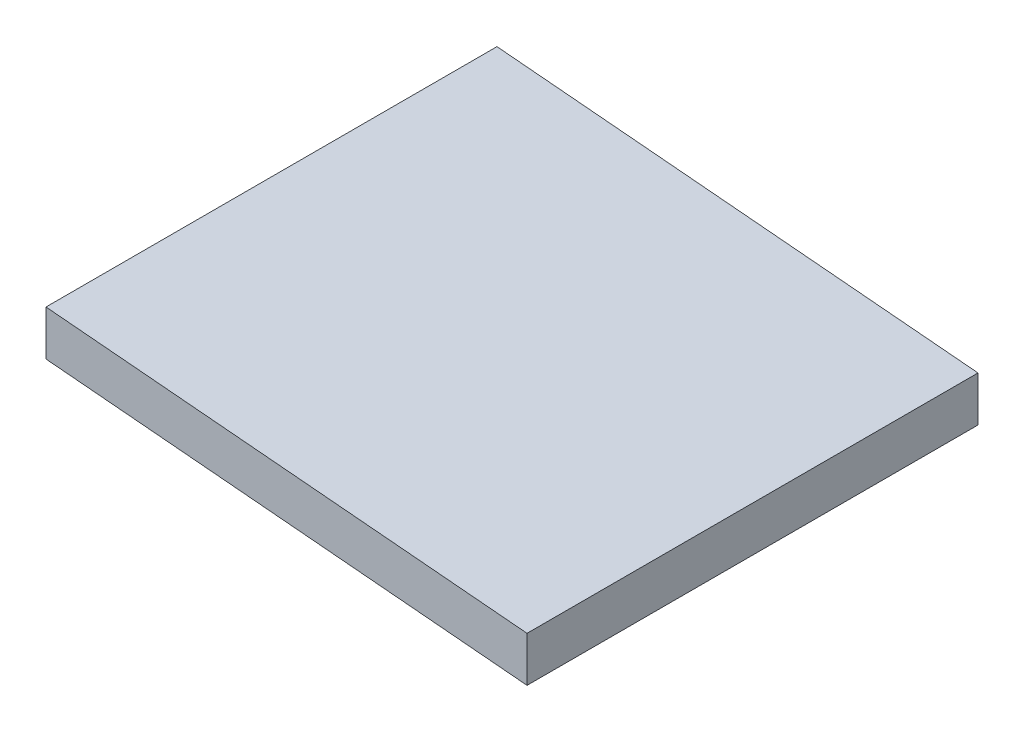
ISO-10303-21;
HEADER;
FILE_DESCRIPTION(('STEP AP214'),'2;1');
FILE_NAME('part.step','',(''),(''),'','','');
FILE_SCHEMA(('AUTOMOTIVE_DESIGN { 1 0 10303 214 1 1 1 1 }'));
ENDSEC;
DATA;
#1=APPLICATION_CONTEXT('core data for automotive mechanical design processes');
#2=APPLICATION_PROTOCOL_DEFINITION('international standard','automotive_design',2000,#1);
#3=PRODUCT_CONTEXT('',#1,'mechanical');
#4=PRODUCT('Part','Part','',(#3));
#5=PRODUCT_RELATED_PRODUCT_CATEGORY('part','',(#4));
#6=PRODUCT_DEFINITION_FORMATION('','',#4);
#7=PRODUCT_DEFINITION_CONTEXT('part definition',#1,'design');
#8=PRODUCT_DEFINITION('design','',#6,#7);
#9=PRODUCT_DEFINITION_SHAPE('','',#8);
#10=(LENGTH_UNIT() NAMED_UNIT(*) SI_UNIT(.MILLI.,.METRE.));
#11=(NAMED_UNIT(*) PLANE_ANGLE_UNIT() SI_UNIT($,.RADIAN.));
#12=(NAMED_UNIT(*) SI_UNIT($,.STERADIAN.) SOLID_ANGLE_UNIT());
#13=UNCERTAINTY_MEASURE_WITH_UNIT(LENGTH_MEASURE(1.E-05),#10,'distance_accuracy_value','');
#14=(GEOMETRIC_REPRESENTATION_CONTEXT(3) GLOBAL_UNCERTAINTY_ASSIGNED_CONTEXT((#13)) GLOBAL_UNIT_ASSIGNED_CONTEXT((#10,
#11,#12)) REPRESENTATION_CONTEXT('',''));
#15=CARTESIAN_POINT('',(0.,0.,0.));
#16=DIRECTION('',(0.,0.,1.));
#17=DIRECTION('',(1.,0.,0.));
#18=AXIS2_PLACEMENT_3D('',#15,#16,#17);
#19=CARTESIAN_POINT('',(0.,3.,30.));
#20=DIRECTION('',(-1.,0.,0.));
#21=DIRECTION('',(0.,-1.,0.));
#22=AXIS2_PLACEMENT_3D('',#19,#20,#21);
#23=PLANE('',#22);
#24=DIRECTION('',(0.,1.,0.));
#25=VECTOR('',#24,1.);
#26=CARTESIAN_POINT('',(0.,3.,0.));
#27=LINE('',#26,#25);
#28=CARTESIAN_POINT('',(0.,0.,0.));
#29=VERTEX_POINT('',#28);
#30=CARTESIAN_POINT('',(0.,3.,0.));
#31=VERTEX_POINT('',#30);
#32=EDGE_CURVE('E110',#29,#31,#27,.T.);
#33=ORIENTED_EDGE('',*,*,#32,.T.);
#34=DIRECTION('',(0.,0.,-1.));
#35=VECTOR('',#34,1.);
#36=CARTESIAN_POINT('',(0.,3.,30.));
#37=LINE('',#36,#35);
#38=CARTESIAN_POINT('',(0.,3.,30.));
#39=VERTEX_POINT('',#38);
#40=EDGE_CURVE('E11',#39,#31,#37,.T.);
#41=ORIENTED_EDGE('',*,*,#40,.F.);
#42=DIRECTION('',(0.,1.,0.));
#43=VECTOR('',#42,1.);
#44=CARTESIAN_POINT('',(0.,3.,30.));
#45=LINE('',#44,#43);
#46=CARTESIAN_POINT('',(0.,0.,30.));
#47=VERTEX_POINT('',#46);
#48=EDGE_CURVE('E94',#47,#39,#45,.T.);
#49=ORIENTED_EDGE('',*,*,#48,.F.);
#50=DIRECTION('',(0.,0.,-1.));
#51=VECTOR('',#50,1.);
#52=CARTESIAN_POINT('',(0.,0.,30.));
#53=LINE('',#52,#51);
#54=EDGE_CURVE('E106',#47,#29,#53,.T.);
#55=ORIENTED_EDGE('',*,*,#54,.T.);
#56=EDGE_LOOP('',(#33,#41,#49,#55));
#57=FACE_BOUND('',#56,.T.);
#58=ADVANCED_FACE('F42',(#57),#23,.F.);
#59=CARTESIAN_POINT('',(-32.,5.79963723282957,30.));
#60=DIRECTION('',(-0.0871557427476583,-0.996194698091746,0.));
#61=DIRECTION('',(0.996194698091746,-0.0871557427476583,0.));
#62=AXIS2_PLACEMENT_3D('',#59,#60,#61);
#63=PLANE('',#62);
#64=DIRECTION('',(-0.996194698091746,0.0871557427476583,0.));
#65=VECTOR('',#64,1.);
#66=CARTESIAN_POINT('',(-32.,5.79963723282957,0.));
#67=LINE('',#66,#65);
#68=CARTESIAN_POINT('',(-32.,5.79963723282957,0.));
#69=VERTEX_POINT('',#68);
#70=EDGE_CURVE('E99',#31,#69,#67,.T.);
#71=ORIENTED_EDGE('',*,*,#70,.T.);
#72=DIRECTION('',(0.,0.,-1.));
#73=VECTOR('',#72,1.);
#74=CARTESIAN_POINT('',(-32.,5.79963723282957,30.));
#75=LINE('',#74,#73);
#76=CARTESIAN_POINT('',(-32.,5.79963723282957,30.));
#77=VERTEX_POINT('',#76);
#78=EDGE_CURVE('E51',#77,#69,#75,.T.);
#79=ORIENTED_EDGE('',*,*,#78,.F.);
#80=DIRECTION('',(-0.996194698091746,0.0871557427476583,0.));
#81=VECTOR('',#80,1.);
#82=CARTESIAN_POINT('',(-32.,5.79963723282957,30.));
#83=LINE('',#82,#81);
#84=EDGE_CURVE('E89',#39,#77,#83,.T.);
#85=ORIENTED_EDGE('',*,*,#84,.F.);
#86=ORIENTED_EDGE('',*,*,#40,.T.);
#87=EDGE_LOOP('',(#71,#79,#85,#86));
#88=FACE_BOUND('',#87,.T.);
#89=ADVANCED_FACE('F98',(#88),#63,.F.);
#90=CARTESIAN_POINT('',(-32.,2.79963723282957,30.));
#91=DIRECTION('',(1.,0.,0.));
#92=DIRECTION('',(0.,1.,0.));
#93=AXIS2_PLACEMENT_3D('',#90,#91,#92);
#94=PLANE('',#93);
#95=DIRECTION('',(0.,-1.,0.));
#96=VECTOR('',#95,1.);
#97=CARTESIAN_POINT('',(-32.,2.79963723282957,0.));
#98=LINE('',#97,#96);
#99=CARTESIAN_POINT('',(-32.,2.79963723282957,0.));
#100=VERTEX_POINT('',#99);
#101=EDGE_CURVE('E76',#69,#100,#98,.T.);
#102=ORIENTED_EDGE('',*,*,#101,.T.);
#103=DIRECTION('',(0.,0.,-1.));
#104=VECTOR('',#103,1.);
#105=CARTESIAN_POINT('',(-32.,2.79963723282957,30.));
#106=LINE('',#105,#104);
#107=CARTESIAN_POINT('',(-32.,2.79963723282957,30.));
#108=VERTEX_POINT('',#107);
#109=EDGE_CURVE('E101',#108,#100,#106,.T.);
#110=ORIENTED_EDGE('',*,*,#109,.F.);
#111=DIRECTION('',(0.,-1.,0.));
#112=VECTOR('',#111,1.);
#113=CARTESIAN_POINT('',(-32.,2.79963723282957,30.));
#114=LINE('',#113,#112);
#115=EDGE_CURVE('E92',#77,#108,#114,.T.);
#116=ORIENTED_EDGE('',*,*,#115,.F.);
#117=ORIENTED_EDGE('',*,*,#78,.T.);
#118=EDGE_LOOP('',(#102,#110,#116,#117));
#119=FACE_BOUND('',#118,.T.);
#120=ADVANCED_FACE('F102',(#119),#94,.F.);
#121=CARTESIAN_POINT('',(0.,0.,30.));
#122=DIRECTION('',(0.0871557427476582,0.996194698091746,0.));
#123=DIRECTION('',(-0.996194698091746,0.0871557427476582,0.));
#124=AXIS2_PLACEMENT_3D('',#121,#122,#123);
#125=PLANE('',#124);
#126=DIRECTION('',(0.996194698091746,-0.0871557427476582,0.));
#127=VECTOR('',#126,1.);
#128=CARTESIAN_POINT('',(0.,0.,0.));
#129=LINE('',#128,#127);
#130=EDGE_CURVE('E82',#100,#29,#129,.T.);
#131=ORIENTED_EDGE('',*,*,#130,.T.);
#132=ORIENTED_EDGE('',*,*,#54,.F.);
#133=DIRECTION('',(0.996194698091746,-0.0871557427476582,0.));
#134=VECTOR('',#133,1.);
#135=CARTESIAN_POINT('',(0.,0.,30.));
#136=LINE('',#135,#134);
#137=EDGE_CURVE('E59',#108,#47,#136,.T.);
#138=ORIENTED_EDGE('',*,*,#137,.F.);
#139=ORIENTED_EDGE('',*,*,#109,.T.);
#140=EDGE_LOOP('',(#131,#132,#138,#139));
#141=FACE_BOUND('',#140,.T.);
#142=ADVANCED_FACE('F123',(#141),#125,.F.);
#143=CARTESIAN_POINT('',(0.,0.,30.));
#144=DIRECTION('',(0.,0.,-1.));
#145=DIRECTION('',(-1.,0.,0.));
#146=AXIS2_PLACEMENT_3D('',#143,#144,#145);
#147=PLANE('',#146);
#148=ORIENTED_EDGE('',*,*,#48,.T.);
#149=ORIENTED_EDGE('',*,*,#84,.T.);
#150=ORIENTED_EDGE('',*,*,#115,.T.);
#151=ORIENTED_EDGE('',*,*,#137,.T.);
#152=EDGE_LOOP('',(#148,#149,#150,#151));
#153=FACE_BOUND('',#152,.T.);
#154=ADVANCED_FACE('F90',(#153),#147,.F.);
#155=CARTESIAN_POINT('',(0.,0.,0.));
#156=DIRECTION('',(0.,0.,-1.));
#157=DIRECTION('',(-1.,0.,0.));
#158=AXIS2_PLACEMENT_3D('',#155,#156,#157);
#159=PLANE('',#158);
#160=ORIENTED_EDGE('',*,*,#32,.F.);
#161=ORIENTED_EDGE('',*,*,#130,.F.);
#162=ORIENTED_EDGE('',*,*,#101,.F.);
#163=ORIENTED_EDGE('',*,*,#70,.F.);
#164=EDGE_LOOP('',(#160,#161,#162,#163));
#165=FACE_BOUND('',#164,.T.);
#166=ADVANCED_FACE('F126',(#165),#159,.T.);
#167=CLOSED_SHELL('',(#58,#89,#120,#142,#154,#166));
#168=MANIFOLD_SOLID_BREP('B2',#167);
#169=ADVANCED_BREP_SHAPE_REPRESENTATION('',(#18,#168),#14);
#170=SHAPE_DEFINITION_REPRESENTATION(#9,#169);
ENDSEC;
END-ISO-10303-21;
